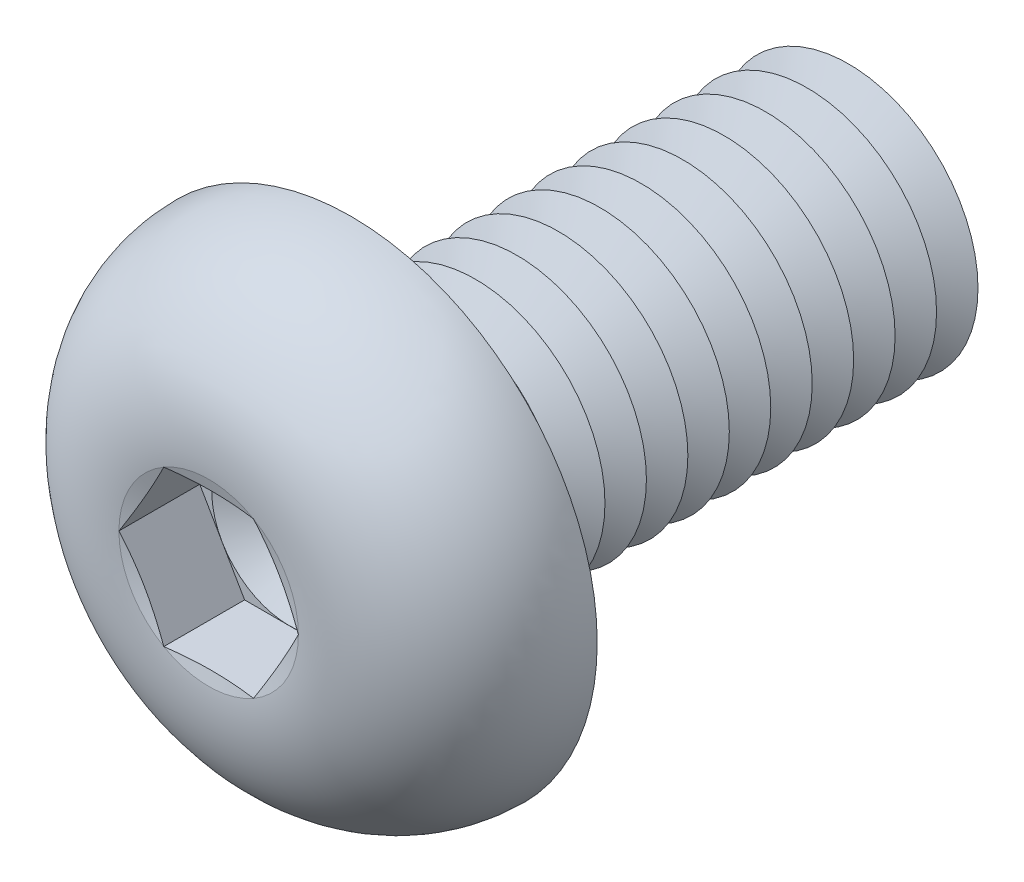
from build123d import *

# Parameters (mm, degrees)
FILLET1_R          = 0.4
LPATTERN1_COUNT    = 12
LPATTERN1_PITCH    = 0.8
CUT_EXTRUDE1_DEPTH = 1.56


with BuildPart() as part:
    # Sketch1 → Revolve1 (revolve)
    with BuildSketch(Plane(origin=(0, 0, 0), x_dir=(0, 0, -1), z_dir=(1, 0, 0)), mode=Mode.PRIVATE) as revolve1_sk:
        with BuildLine():
            Line((0, 2.5), (0, 4.75))
            ThreePointArc((0, 4.75), (-2.041477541, 3.848329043), (-2.75, 1.73205))
            Line((-2.75, 1.73205), (-2.517949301, 0.866025))
            Line((-2.517949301, 0.866025), (-2.75, 0.866025))
            Line((-2.75, 0.866025), (-2.75, 0))
            Line((-2.75, 0), (10, 0))
            Line((10, 0), (10, 2.5))
            Line((10, 2.5), (0, 2.5))
        make_face()
    revolve(revolve1_sk.sketch.rotate(Axis((0, 0, -10), (0, 0, 1)), 90), axis=Axis((0, 0, -10), (0, 0, 1)))

    # Fillet1
    fillet1_edges = [part.edges().sort_by_distance(p)[0] for p in [
        (2.5, 0, 0),
    ]]
    fillet(fillet1_edges, radius=FILLET1_R)

    # Sketch2 → Cut-Revolve1 (revolve, cut)
    with BuildSketch(Plane(origin=(0, 0, 0), x_dir=(0, 0, -1), z_dir=(1, 0, 0)), mode=Mode.PRIVATE) as cut_revolve1_sk:
        Polygon((9.6, 2.5), (10.4, 2.5), (10, 1.807179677), align=None)
    cut_revolve1 = revolve(cut_revolve1_sk.sketch.rotate(Axis((0, 0, -10), (0, 0, -1)), 270), axis=Axis((0, 0, -10), (0, 0, -1)), mode=Mode.SUBTRACT)

    # LPattern1: Cut-Revolve1 ×12
    with Locations(*[(0, 0, i * LPATTERN1_PITCH) for i in range(1, LPATTERN1_COUNT)]):
        add(cut_revolve1, mode=Mode.SUBTRACT)

    # Sketch3 → Cut-Extrude1 (cut)
    with BuildSketch(Plane.XY.offset(2.75)):
        Polygon((0.866025, 1.499999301), (-0.866025, 1.499999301), (-1.73205, 0), (-0.866025, -1.499999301), (0.866025, -1.499999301), (1.73205, 0), align=None)
    extrude(amount=-CUT_EXTRUDE1_DEPTH, mode=Mode.SUBTRACT)

    # Cut-Extrude2 cone 1 section (on through the dimple's axis) → Cut-Extrude2 (revolve, cut)
    with BuildSketch(Plane(origin=(0, 0, 1.19), x_dir=(0, -1, 0), z_dir=(1, 0, 0))):
        Polygon((0, 0), (1.499999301, 0), (0, 0.866025), align=None)
    revolve(axis=Axis((0, 0, 1.19), (0, 0, -1)), mode=Mode.SUBTRACT)


solid = part.part
